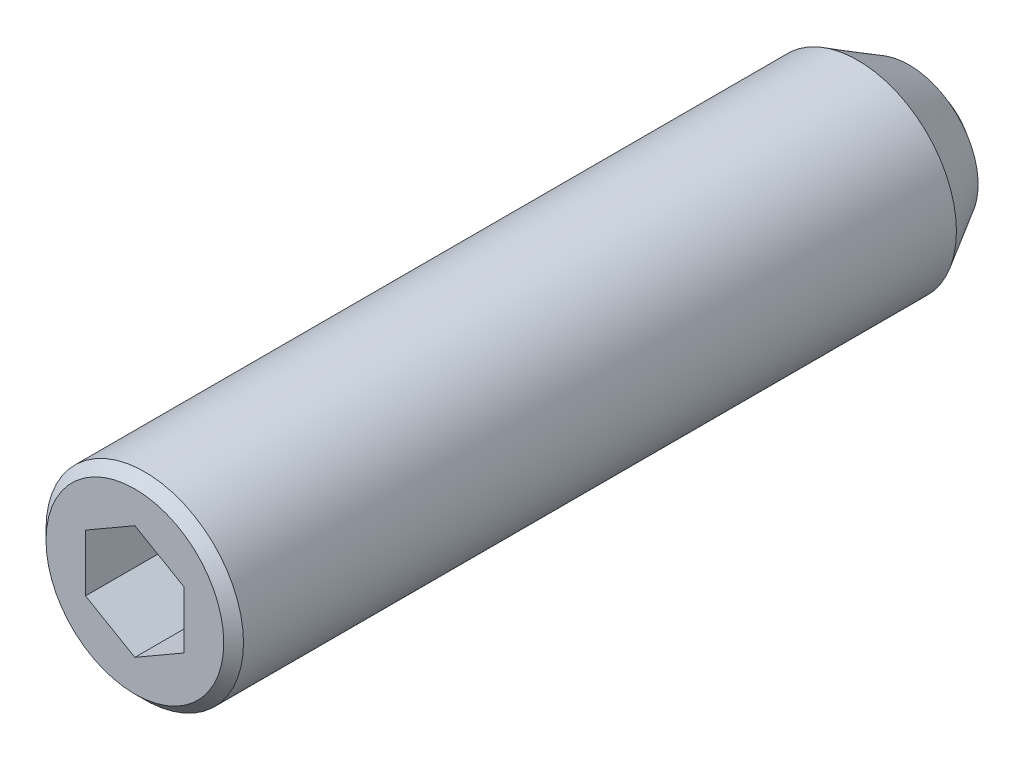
ISO-10303-21;
HEADER;
FILE_DESCRIPTION(('STEP AP214'),'2;1');
FILE_NAME('part.step','',(''),(''),'','','');
FILE_SCHEMA(('AUTOMOTIVE_DESIGN { 1 0 10303 214 1 1 1 1 }'));
ENDSEC;
DATA;
#1=APPLICATION_CONTEXT('core data for automotive mechanical design processes');
#2=APPLICATION_PROTOCOL_DEFINITION('international standard','automotive_design',2000,#1);
#3=PRODUCT_CONTEXT('',#1,'mechanical');
#4=PRODUCT('Part','Part','',(#3));
#5=PRODUCT_RELATED_PRODUCT_CATEGORY('part','',(#4));
#6=PRODUCT_DEFINITION_FORMATION('','',#4);
#7=PRODUCT_DEFINITION_CONTEXT('part definition',#1,'design');
#8=PRODUCT_DEFINITION('design','',#6,#7);
#9=PRODUCT_DEFINITION_SHAPE('','',#8);
#10=(LENGTH_UNIT() NAMED_UNIT(*) SI_UNIT(.MILLI.,.METRE.));
#11=(NAMED_UNIT(*) PLANE_ANGLE_UNIT() SI_UNIT($,.RADIAN.));
#12=(NAMED_UNIT(*) SI_UNIT($,.STERADIAN.) SOLID_ANGLE_UNIT());
#13=UNCERTAINTY_MEASURE_WITH_UNIT(LENGTH_MEASURE(1.E-05),#10,'distance_accuracy_value','');
#14=(GEOMETRIC_REPRESENTATION_CONTEXT(3) GLOBAL_UNCERTAINTY_ASSIGNED_CONTEXT((#13)) GLOBAL_UNIT_ASSIGNED_CONTEXT((#10,
#11,#12)) REPRESENTATION_CONTEXT('',''));
#15=CARTESIAN_POINT('',(0.,0.,0.));
#16=DIRECTION('',(0.,0.,1.));
#17=DIRECTION('',(1.,0.,0.));
#18=AXIS2_PLACEMENT_3D('',#15,#16,#17);
#19=CARTESIAN_POINT('',(1.25,0.721687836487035,17.5));
#20=DIRECTION('',(0.5,0.866025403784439,0.));
#21=DIRECTION('',(0.866025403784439,-0.5,0.));
#22=AXIS2_PLACEMENT_3D('',#19,#20,#21);
#23=PLANE('',#22);
#24=DIRECTION('',(0.,0.,1.));
#25=VECTOR('',#24,1.);
#26=CARTESIAN_POINT('',(1.25,0.721687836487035,17.5));
#27=LINE('',#26,#25);
#28=CARTESIAN_POINT('',(1.25,0.721687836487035,17.5));
#29=VERTEX_POINT('',#28);
#30=CARTESIAN_POINT('',(1.25,0.721687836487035,20.));
#31=VERTEX_POINT('',#30);
#32=EDGE_CURVE('E96',#29,#31,#27,.T.);
#33=ORIENTED_EDGE('',*,*,#32,.T.);
#34=DIRECTION('',(-0.866025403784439,0.5,0.));
#35=VECTOR('',#34,1.);
#36=CARTESIAN_POINT('',(1.25,0.721687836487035,20.));
#37=LINE('',#36,#35);
#38=CARTESIAN_POINT('',(0.,1.44337567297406,20.));
#39=VERTEX_POINT('',#38);
#40=EDGE_CURVE('E29',#31,#39,#37,.T.);
#41=ORIENTED_EDGE('',*,*,#40,.T.);
#42=DIRECTION('',(0.,0.,1.));
#43=VECTOR('',#42,1.);
#44=CARTESIAN_POINT('',(0.,1.44337567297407,17.5));
#45=LINE('',#44,#43);
#46=CARTESIAN_POINT('',(0.,1.44337567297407,17.5));
#47=VERTEX_POINT('',#46);
#48=EDGE_CURVE('E34',#47,#39,#45,.T.);
#49=ORIENTED_EDGE('',*,*,#48,.F.);
#50=DIRECTION('',(-0.866025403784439,0.5,0.));
#51=VECTOR('',#50,1.);
#52=CARTESIAN_POINT('',(1.25,0.721687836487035,17.5));
#53=LINE('',#52,#51);
#54=EDGE_CURVE('E90',#29,#47,#53,.T.);
#55=ORIENTED_EDGE('',*,*,#54,.F.);
#56=EDGE_LOOP('',(#33,#41,#49,#55));
#57=FACE_BOUND('',#56,.T.);
#58=ADVANCED_FACE('F14',(#57),#23,.F.);
#59=CARTESIAN_POINT('',(1.25,-0.721687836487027,17.5));
#60=DIRECTION('',(1.,0.,0.));
#61=DIRECTION('',(0.,-1.,0.));
#62=AXIS2_PLACEMENT_3D('',#59,#60,#61);
#63=PLANE('',#62);
#64=DIRECTION('',(0.,0.,1.));
#65=VECTOR('',#64,1.);
#66=CARTESIAN_POINT('',(1.25,-0.721687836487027,17.5));
#67=LINE('',#66,#65);
#68=CARTESIAN_POINT('',(1.25,-0.721687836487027,17.5));
#69=VERTEX_POINT('',#68);
#70=CARTESIAN_POINT('',(1.25,-0.721687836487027,20.));
#71=VERTEX_POINT('',#70);
#72=EDGE_CURVE('E93',#69,#71,#67,.T.);
#73=ORIENTED_EDGE('',*,*,#72,.T.);
#74=DIRECTION('',(0.,1.,0.));
#75=VECTOR('',#74,1.);
#76=CARTESIAN_POINT('',(1.25,-0.721687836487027,20.));
#77=LINE('',#76,#75);
#78=EDGE_CURVE('E150',#71,#31,#77,.T.);
#79=ORIENTED_EDGE('',*,*,#78,.T.);
#80=ORIENTED_EDGE('',*,*,#32,.F.);
#81=DIRECTION('',(0.,1.,0.));
#82=VECTOR('',#81,1.);
#83=CARTESIAN_POINT('',(1.25,-0.721687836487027,17.5));
#84=LINE('',#83,#82);
#85=EDGE_CURVE('E85',#69,#29,#84,.T.);
#86=ORIENTED_EDGE('',*,*,#85,.F.);
#87=EDGE_LOOP('',(#73,#79,#80,#86));
#88=FACE_BOUND('',#87,.T.);
#89=ADVANCED_FACE('F119',(#88),#63,.F.);
#90=CARTESIAN_POINT('',(1.25,-0.721687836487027,17.5));
#91=DIRECTION('',(-0.5,0.866025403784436,0.));
#92=DIRECTION('',(0.866025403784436,0.5,0.));
#93=AXIS2_PLACEMENT_3D('',#90,#91,#92);
#94=PLANE('',#93);
#95=DIRECTION('',(0.,0.,1.));
#96=VECTOR('',#95,1.);
#97=CARTESIAN_POINT('',(0.,-1.44337567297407,17.5));
#98=LINE('',#97,#96);
#99=CARTESIAN_POINT('',(0.,-1.44337567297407,17.5));
#100=VERTEX_POINT('',#99);
#101=CARTESIAN_POINT('',(0.,-1.44337567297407,20.));
#102=VERTEX_POINT('',#101);
#103=EDGE_CURVE('E68',#100,#102,#98,.T.);
#104=ORIENTED_EDGE('',*,*,#103,.T.);
#105=DIRECTION('',(-0.866025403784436,-0.5,0.));
#106=VECTOR('',#105,1.);
#107=CARTESIAN_POINT('',(1.25,-0.721687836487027,20.));
#108=LINE('',#107,#106);
#109=EDGE_CURVE('E144',#71,#102,#108,.T.);
#110=ORIENTED_EDGE('',*,*,#109,.F.);
#111=ORIENTED_EDGE('',*,*,#72,.F.);
#112=DIRECTION('',(-0.866025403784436,-0.5,0.));
#113=VECTOR('',#112,1.);
#114=CARTESIAN_POINT('',(1.25,-0.721687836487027,17.5));
#115=LINE('',#114,#113);
#116=EDGE_CURVE('E83',#69,#100,#115,.T.);
#117=ORIENTED_EDGE('',*,*,#116,.T.);
#118=EDGE_LOOP('',(#104,#110,#111,#117));
#119=FACE_BOUND('',#118,.T.);
#120=ADVANCED_FACE('F124',(#119),#94,.T.);
#121=CARTESIAN_POINT('',(-1.25,-0.721687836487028,17.5));
#122=DIRECTION('',(-0.5,-0.866025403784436,0.));
#123=DIRECTION('',(-0.866025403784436,0.5,0.));
#124=AXIS2_PLACEMENT_3D('',#121,#122,#123);
#125=PLANE('',#124);
#126=DIRECTION('',(0.,0.,1.));
#127=VECTOR('',#126,1.);
#128=CARTESIAN_POINT('',(-1.25,-0.721687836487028,17.5));
#129=LINE('',#128,#127);
#130=CARTESIAN_POINT('',(-1.25,-0.721687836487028,17.5));
#131=VERTEX_POINT('',#130);
#132=CARTESIAN_POINT('',(-1.25,-0.721687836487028,20.));
#133=VERTEX_POINT('',#132);
#134=EDGE_CURVE('E56',#131,#133,#129,.T.);
#135=ORIENTED_EDGE('',*,*,#134,.T.);
#136=DIRECTION('',(0.866025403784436,-0.5,0.));
#137=VECTOR('',#136,1.);
#138=CARTESIAN_POINT('',(-1.25,-0.721687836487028,20.));
#139=LINE('',#138,#137);
#140=EDGE_CURVE('E147',#133,#102,#139,.T.);
#141=ORIENTED_EDGE('',*,*,#140,.T.);
#142=ORIENTED_EDGE('',*,*,#103,.F.);
#143=DIRECTION('',(0.866025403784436,-0.5,0.));
#144=VECTOR('',#143,1.);
#145=CARTESIAN_POINT('',(-1.25,-0.721687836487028,17.5));
#146=LINE('',#145,#144);
#147=EDGE_CURVE('E76',#131,#100,#146,.T.);
#148=ORIENTED_EDGE('',*,*,#147,.F.);
#149=EDGE_LOOP('',(#135,#141,#142,#148));
#150=FACE_BOUND('',#149,.T.);
#151=ADVANCED_FACE('F81',(#150),#125,.F.);
#152=CARTESIAN_POINT('',(-1.25,-0.721687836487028,17.5));
#153=DIRECTION('',(1.,0.,0.));
#154=DIRECTION('',(0.,0.,1.));
#155=AXIS2_PLACEMENT_3D('',#152,#153,#154);
#156=PLANE('',#155);
#157=DIRECTION('',(0.,0.,1.));
#158=VECTOR('',#157,1.);
#159=CARTESIAN_POINT('',(-1.25,0.72168783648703,17.5));
#160=LINE('',#159,#158);
#161=CARTESIAN_POINT('',(-1.25,0.72168783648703,17.5));
#162=VERTEX_POINT('',#161);
#163=CARTESIAN_POINT('',(-1.25,0.72168783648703,20.));
#164=VERTEX_POINT('',#163);
#165=EDGE_CURVE('E69',#162,#164,#160,.T.);
#166=ORIENTED_EDGE('',*,*,#165,.T.);
#167=DIRECTION('',(0.,1.,0.));
#168=VECTOR('',#167,1.);
#169=CARTESIAN_POINT('',(-1.25,-0.721687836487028,20.));
#170=LINE('',#169,#168);
#171=EDGE_CURVE('E63',#133,#164,#170,.T.);
#172=ORIENTED_EDGE('',*,*,#171,.F.);
#173=ORIENTED_EDGE('',*,*,#134,.F.);
#174=DIRECTION('',(0.,1.,0.));
#175=VECTOR('',#174,1.);
#176=CARTESIAN_POINT('',(-1.25,-0.721687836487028,17.5));
#177=LINE('',#176,#175);
#178=EDGE_CURVE('E60',#131,#162,#177,.T.);
#179=ORIENTED_EDGE('',*,*,#178,.T.);
#180=EDGE_LOOP('',(#166,#172,#173,#179));
#181=FACE_BOUND('',#180,.T.);
#182=ADVANCED_FACE('F59',(#181),#156,.T.);
#183=CARTESIAN_POINT('',(-1.25,0.72168783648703,17.5));
#184=DIRECTION('',(0.5,-0.866025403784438,0.));
#185=DIRECTION('',(-0.866025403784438,-0.5,0.));
#186=AXIS2_PLACEMENT_3D('',#183,#184,#185);
#187=PLANE('',#186);
#188=DIRECTION('',(0.866025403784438,0.5,0.));
#189=VECTOR('',#188,1.);
#190=CARTESIAN_POINT('',(-1.25,0.72168783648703,17.5));
#191=LINE('',#190,#189);
#192=EDGE_CURVE('E79',#162,#47,#191,.T.);
#193=ORIENTED_EDGE('',*,*,#192,.T.);
#194=ORIENTED_EDGE('',*,*,#48,.T.);
#195=DIRECTION('',(0.866025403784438,0.5,0.));
#196=VECTOR('',#195,1.);
#197=CARTESIAN_POINT('',(-1.25,0.72168783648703,20.));
#198=LINE('',#197,#196);
#199=EDGE_CURVE('E157',#164,#39,#198,.T.);
#200=ORIENTED_EDGE('',*,*,#199,.F.);
#201=ORIENTED_EDGE('',*,*,#165,.F.);
#202=EDGE_LOOP('',(#193,#194,#200,#201));
#203=FACE_BOUND('',#202,.T.);
#204=ADVANCED_FACE('F128',(#203),#187,.T.);
#205=CARTESIAN_POINT('',(2.5,0.,17.5));
#206=DIRECTION('',(0.,0.,1.));
#207=DIRECTION('',(-1.,0.,0.));
#208=AXIS2_PLACEMENT_3D('',#205,#206,#207);
#209=PLANE('',#208);
#210=ORIENTED_EDGE('',*,*,#54,.T.);
#211=ORIENTED_EDGE('',*,*,#192,.F.);
#212=ORIENTED_EDGE('',*,*,#178,.F.);
#213=ORIENTED_EDGE('',*,*,#147,.T.);
#214=ORIENTED_EDGE('',*,*,#116,.F.);
#215=ORIENTED_EDGE('',*,*,#85,.T.);
#216=EDGE_LOOP('',(#210,#211,#212,#213,#214,#215));
#217=FACE_BOUND('',#216,.T.);
#218=ADVANCED_FACE('F74',(#217),#209,.T.);
#219=CARTESIAN_POINT('',(0.,0.,19.75));
#220=DIRECTION('',(0.,0.,-1.));
#221=DIRECTION('',(1.,0.,0.));
#222=AXIS2_PLACEMENT_3D('',#219,#220,#221);
#223=CYLINDRICAL_SURFACE('',#222,2.5);
#224=CARTESIAN_POINT('',(0.,0.,19.75));
#225=DIRECTION('',(0.,0.,-1.));
#226=DIRECTION('',(1.,0.,0.));
#227=AXIS2_PLACEMENT_3D('',#224,#225,#226);
#228=CIRCLE('',#227,2.5);
#229=CARTESIAN_POINT('',(2.5,0.,19.75));
#230=VERTEX_POINT('',#229);
#231=EDGE_CURVE('E9',#230,#230,#228,.T.);
#232=ORIENTED_EDGE('',*,*,#231,.T.);
#233=EDGE_LOOP('',(#232));
#234=FACE_BOUND('',#233,.T.);
#235=CARTESIAN_POINT('',(0.,0.,1.69903810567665));
#236=DIRECTION('',(0.,0.,-1.));
#237=DIRECTION('',(-1.,0.,0.));
#238=AXIS2_PLACEMENT_3D('',#235,#236,#237);
#239=CIRCLE('',#238,2.5);
#240=CARTESIAN_POINT('',(-2.5,0.,1.69903810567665));
#241=VERTEX_POINT('',#240);
#242=EDGE_CURVE('E175',#241,#241,#239,.T.);
#243=ORIENTED_EDGE('',*,*,#242,.F.);
#244=EDGE_LOOP('',(#243));
#245=FACE_BOUND('',#244,.T.);
#246=ADVANCED_FACE('F16',(#234,#245),#223,.T.);
#247=CARTESIAN_POINT('',(0.,0.,19.75));
#248=DIRECTION('',(0.,0.,-1.));
#249=DIRECTION('',(1.,0.,0.));
#250=AXIS2_PLACEMENT_3D('',#247,#248,#249);
#251=CONICAL_SURFACE('',#250,2.5,0.785398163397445);
#252=CARTESIAN_POINT('',(0.,0.,20.));
#253=DIRECTION('',(0.,0.,-1.));
#254=DIRECTION('',(1.,0.,0.));
#255=AXIS2_PLACEMENT_3D('',#252,#253,#254);
#256=CIRCLE('',#255,2.25);
#257=CARTESIAN_POINT('',(2.25,0.,20.));
#258=VERTEX_POINT('',#257);
#259=EDGE_CURVE('E22',#258,#258,#256,.T.);
#260=ORIENTED_EDGE('',*,*,#259,.T.);
#261=EDGE_LOOP('',(#260));
#262=FACE_BOUND('',#261,.T.);
#263=ORIENTED_EDGE('',*,*,#231,.F.);
#264=EDGE_LOOP('',(#263));
#265=FACE_BOUND('',#264,.T.);
#266=ADVANCED_FACE('F100',(#262,#265),#251,.T.);
#267=CARTESIAN_POINT('',(0.,0.,20.));
#268=DIRECTION('',(0.,0.,-1.));
#269=DIRECTION('',(1.,0.,0.));
#270=AXIS2_PLACEMENT_3D('',#267,#268,#269);
#271=PLANE('',#270);
#272=ORIENTED_EDGE('',*,*,#199,.T.);
#273=ORIENTED_EDGE('',*,*,#40,.F.);
#274=ORIENTED_EDGE('',*,*,#78,.F.);
#275=ORIENTED_EDGE('',*,*,#109,.T.);
#276=ORIENTED_EDGE('',*,*,#140,.F.);
#277=ORIENTED_EDGE('',*,*,#171,.T.);
#278=EDGE_LOOP('',(#272,#273,#274,#275,#276,#277));
#279=FACE_BOUND('',#278,.T.);
#280=ORIENTED_EDGE('',*,*,#259,.F.);
#281=EDGE_LOOP('',(#280));
#282=FACE_BOUND('',#281,.T.);
#283=ADVANCED_FACE('F103',(#279,#282),#271,.F.);
#284=CARTESIAN_POINT('',(0.,0.,0.));
#285=DIRECTION('',(0.,0.,-1.));
#286=DIRECTION('',(-1.,0.,0.));
#287=AXIS2_PLACEMENT_3D('',#284,#285,#286);
#288=PLANE('',#287);
#289=CARTESIAN_POINT('',(0.,0.,0.));
#290=DIRECTION('',(0.,0.,-1.));
#291=DIRECTION('',(-1.,0.,0.));
#292=AXIS2_PLACEMENT_3D('',#289,#290,#291);
#293=CIRCLE('',#292,1.2);
#294=CARTESIAN_POINT('',(-1.2,0.,0.));
#295=VERTEX_POINT('',#294);
#296=EDGE_CURVE('E152',#295,#295,#293,.T.);
#297=ORIENTED_EDGE('',*,*,#296,.T.);
#298=EDGE_LOOP('',(#297));
#299=FACE_BOUND('',#298,.T.);
#300=ADVANCED_FACE('F105',(#299),#288,.T.);
#301=CARTESIAN_POINT('',(0.,0.,0.9));
#302=DIRECTION('',(0.,0.,-1.));
#303=DIRECTION('',(-1.,0.,0.));
#304=AXIS2_PLACEMENT_3D('',#301,#302,#303);
#305=SPHERICAL_SURFACE('',#304,1.5);
#306=CARTESIAN_POINT('',(0.,0.,0.4));
#307=DIRECTION('',(0.,0.,-1.));
#308=DIRECTION('',(-1.,0.,0.));
#309=AXIS2_PLACEMENT_3D('',#306,#307,#308);
#310=CIRCLE('',#309,1.41421356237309);
#311=CARTESIAN_POINT('',(-1.41421356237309,0.,0.4));
#312=VERTEX_POINT('',#311);
#313=EDGE_CURVE('E169',#312,#312,#310,.T.);
#314=CARTESIAN_POINT('',(-1.41421356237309,0.,0.4));
#315=CARTESIAN_POINT('',(-1.41263197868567,0.,0.395526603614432));
#316=CARTESIAN_POINT('',(-1.41102916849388,0.,0.391060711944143));
#317=CARTESIAN_POINT('',(-1.4077812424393,0.,0.382144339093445));
#318=CARTESIAN_POINT('',(-1.40613612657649,0.,0.377693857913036));
#319=CARTESIAN_POINT('',(-1.40280373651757,0.,0.368808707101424));
#320=CARTESIAN_POINT('',(-1.40111646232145,0.,0.364374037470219));
#321=CARTESIAN_POINT('',(-1.39769990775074,0.,0.355520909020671));
#322=CARTESIAN_POINT('',(-1.39597062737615,0.,0.351102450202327));
#323=CARTESIAN_POINT('',(-1.3924702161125,0.,0.342282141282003));
#324=CARTESIAN_POINT('',(-1.39069908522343,0.,0.337880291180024));
#325=CARTESIAN_POINT('',(-1.38711513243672,0.,0.329093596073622));
#326=CARTESIAN_POINT('',(-1.38530231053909,0.,0.324708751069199));
#327=CARTESIAN_POINT('',(-1.38163513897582,0.,0.315956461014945));
#328=CARTESIAN_POINT('',(-1.37978078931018,0.,0.311589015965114));
#329=CARTESIAN_POINT('',(-1.3760307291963,0.,0.302871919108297));
#330=CARTESIAN_POINT('',(-1.37413501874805,0.,0.29852226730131));
#331=CARTESIAN_POINT('',(-1.37030240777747,0.,0.289841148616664));
#332=CARTESIAN_POINT('',(-1.36836550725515,0.,0.285509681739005));
#333=CARTESIAN_POINT('',(-1.36445069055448,0.,0.276865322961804));
#334=CARTESIAN_POINT('',(-1.36247277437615,0.,0.272552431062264));
#335=CARTESIAN_POINT('',(-1.35847610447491,0.,0.263945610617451));
#336=CARTESIAN_POINT('',(-1.356457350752,0.,0.25965168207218));
#337=CARTESIAN_POINT('',(-1.3523791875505,0.,0.251083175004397));
#338=CARTESIAN_POINT('',(-1.3503197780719,0.,0.246808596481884));
#339=CARTESIAN_POINT('',(-1.34616048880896,0.,0.238279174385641));
#340=CARTESIAN_POINT('',(-1.34406060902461,0.,0.23402433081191));
#341=CARTESIAN_POINT('',(-1.33982056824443,0.,0.225534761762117));
#342=CARTESIAN_POINT('',(-1.33768040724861,0.,0.221300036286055));
#343=CARTESIAN_POINT('',(-1.3333599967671,0.,0.212851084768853));
#344=CARTESIAN_POINT('',(-1.33117974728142,0.,0.208636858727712));
#345=CARTESIAN_POINT('',(-1.32677935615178,0.,0.20022928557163));
#346=CARTESIAN_POINT('',(-1.32455921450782,0.,0.196035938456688));
#347=CARTESIAN_POINT('',(-1.32007923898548,0.,0.187670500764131));
#348=CARTESIAN_POINT('',(-1.31781940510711,0.,0.183498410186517));
#349=CARTESIAN_POINT('',(-1.31326024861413,0.,0.175175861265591));
#350=CARTESIAN_POINT('',(-1.31096092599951,0.,0.171025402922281));
#351=CARTESIAN_POINT('',(-1.30632299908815,0.,0.162746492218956));
#352=CARTESIAN_POINT('',(-1.30398439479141,0.,0.158618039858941));
#353=CARTESIAN_POINT('',(-1.29926811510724,0.,0.150383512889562));
#354=CARTESIAN_POINT('',(-1.29689043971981,0.,0.146277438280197));
#355=CARTESIAN_POINT('',(-1.29209623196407,0.,0.138088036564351));
#356=CARTESIAN_POINT('',(-1.28967969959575,0.,0.13400470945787));
#357=CARTESIAN_POINT('',(-1.2848079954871,0.,0.125861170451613));
#358=CARTESIAN_POINT('',(-1.28235282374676,0.,0.121800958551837));
#359=CARTESIAN_POINT('',(-1.27740406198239,0.,0.113704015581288));
#360=CARTESIAN_POINT('',(-1.27491047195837,0.,0.109667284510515));
#361=CARTESIAN_POINT('',(-1.26988509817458,0.,0.101617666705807));
#362=CARTESIAN_POINT('',(-1.2673533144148,0.,0.0976047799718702));
#363=CARTESIAN_POINT('',(-1.2622517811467,0.,0.0896032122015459));
#364=CARTESIAN_POINT('',(-1.25968203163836,0.,0.0856145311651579));
#365=CARTESIAN_POINT('',(-1.25450479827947,0.,0.0776617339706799));
#366=CARTESIAN_POINT('',(-1.25189731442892,0.,0.0736976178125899));
#367=CARTESIAN_POINT('',(-1.24664484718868,0.,0.0657943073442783));
#368=CARTESIAN_POINT('',(-1.24399986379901,0.,0.0618551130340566));
#369=CARTESIAN_POINT('',(-1.23867263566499,0.,0.0540020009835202));
#370=CARTESIAN_POINT('',(-1.23599039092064,0.,0.0500880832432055));
#371=CARTESIAN_POINT('',(-1.23058888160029,0.,0.0422858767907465));
#372=CARTESIAN_POINT('',(-1.22786961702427,0.,0.0383975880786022));
#373=CARTESIAN_POINT('',(-1.22239431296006,0.,0.0306469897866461));
#374=CARTESIAN_POINT('',(-1.21963827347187,0.,0.0267846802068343));
#375=CARTESIAN_POINT('',(-1.21408966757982,0.,0.0190863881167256));
#376=CARTESIAN_POINT('',(-1.21129710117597,0.,0.0152504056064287));
#377=CARTESIAN_POINT('',(-1.20567569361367,0.,0.00760511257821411));
#378=CARTESIAN_POINT('',(-1.20284685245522,0.,0.00379580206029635));
#379=CARTESIAN_POINT('',(-1.2,0.,0.));
#380=B_SPLINE_CURVE_WITH_KNOTS('',3,(#314,#315,#316,#317,#318,#319,#320,#321,#322,#323,#324,
#325,#326,#327,#328,#329,#330,#331,#332,#333,#334,#335,#336,#337,#338,#339,#340,#341,#342,#343,
#344,#345,#346,#347,#348,#349,#350,#351,#352,#353,#354,#355,#356,#357,#358,#359,#360,#361,#362,
#363,#364,#365,#366,#367,#368,#369,#370,#371,#372,#373,#374,#375,#376,#377,#378,#379),
.UNSPECIFIED.,.F.,.F.,(4,2,2,2,2,2,2,2,2,2,2,2,2,2,2,2,2,2,2,2,2,2,2,2,2,2,2,2,2,2,2,2,4),(0.,
0.0142342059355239,0.0284684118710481,0.0427026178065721,0.0569368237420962,0.0711710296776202,
0.0854052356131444,0.0996394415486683,0.113873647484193,0.128107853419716,0.14234205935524,
0.156576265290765,0.170810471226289,0.185044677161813,0.199278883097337,0.213513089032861,
0.227747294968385,0.241981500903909,0.256215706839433,0.270449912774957,0.284684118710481,
0.298918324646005,0.313152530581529,0.327386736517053,0.341620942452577,0.355855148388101,
0.370089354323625,0.384323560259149,0.398557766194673,0.412791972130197,0.427026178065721,
0.441260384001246,0.45549458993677),.UNSPECIFIED.);
#381=EDGE_CURVE('BSEAM113',#312,#295,#380,.T.);
#382=ORIENTED_EDGE('',*,*,#313,.T.);
#383=ORIENTED_EDGE('',*,*,#296,.F.);
#384=ORIENTED_EDGE('',*,*,#381,.T.);
#385=ORIENTED_EDGE('',*,*,#381,.F.);
#386=EDGE_LOOP('',(#382,#384,#383,#385));
#387=FACE_BOUND('',#386,.T.);
#388=ADVANCED_FACE('F113',(#387),#305,.T.);
#389=CARTESIAN_POINT('',(-1.41421356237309,0.,0.4));
#390=DIRECTION('',(0.,0.,-1.));
#391=DIRECTION('',(-1.,0.,0.));
#392=AXIS2_PLACEMENT_3D('',#389,#390,#391);
#393=PLANE('',#392);
#394=CARTESIAN_POINT('',(0.,0.,0.4));
#395=DIRECTION('',(0.,0.,-1.));
#396=DIRECTION('',(-1.,0.,0.));
#397=AXIS2_PLACEMENT_3D('',#394,#395,#396);
#398=CIRCLE('',#397,1.75);
#399=CARTESIAN_POINT('',(-1.75,0.,0.4));
#400=VERTEX_POINT('',#399);
#401=EDGE_CURVE('E172',#400,#400,#398,.T.);
#402=ORIENTED_EDGE('',*,*,#401,.T.);
#403=EDGE_LOOP('',(#402));
#404=FACE_BOUND('',#403,.T.);
#405=ORIENTED_EDGE('',*,*,#313,.F.);
#406=EDGE_LOOP('',(#405));
#407=FACE_BOUND('',#406,.T.);
#408=ADVANCED_FACE('F252',(#404,#407),#393,.T.);
#409=CARTESIAN_POINT('',(0.,0.,0.4));
#410=DIRECTION('',(0.,0.,1.));
#411=DIRECTION('',(1.,0.,0.));
#412=AXIS2_PLACEMENT_3D('',#409,#410,#411);
#413=CONICAL_SURFACE('',#412,1.75,0.523598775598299);
#414=ORIENTED_EDGE('',*,*,#242,.T.);
#415=EDGE_LOOP('',(#414));
#416=FACE_BOUND('',#415,.T.);
#417=ORIENTED_EDGE('',*,*,#401,.F.);
#418=EDGE_LOOP('',(#417));
#419=FACE_BOUND('',#418,.T.);
#420=ADVANCED_FACE('F179',(#416,#419),#413,.T.);
#421=CLOSED_SHELL('',(#58,#89,#120,#151,#182,#204,#218,#246,#266,#283,#300,#388,#408,#420));
#422=MANIFOLD_SOLID_BREP('B1',#421);
#423=ADVANCED_BREP_SHAPE_REPRESENTATION('',(#18,#422),#14);
#424=SHAPE_DEFINITION_REPRESENTATION(#9,#423);
ENDSEC;
END-ISO-10303-21;
